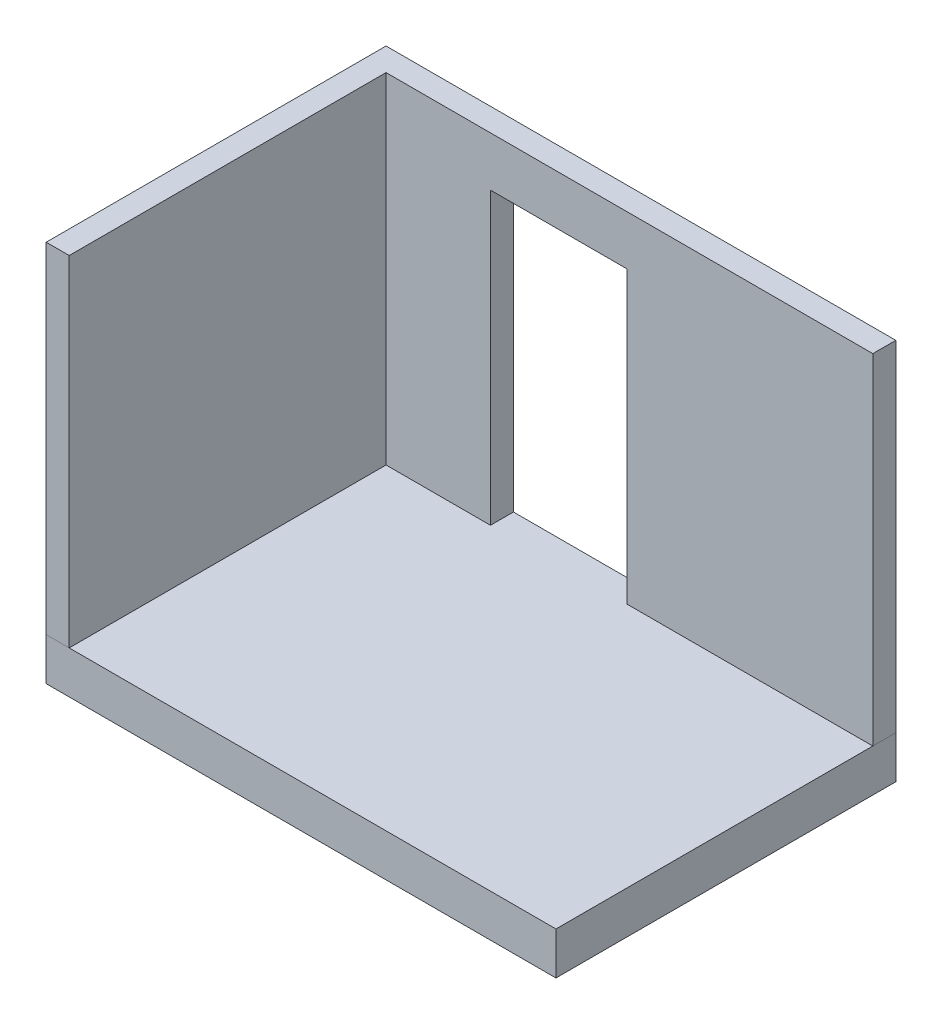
from build123d import *

# Parameters (mm, degrees)
SKETCH1_W           = 3657.6
SKETCH1_H           = 2438.4
FLOOR_2_DEPTH       = 304.8
WALLS_DEPTH         = 2438.4
SKETCH3_W           = 977.9
SKETCH3_H           = 2082.8
ROUGH_OPENING_DEPTH = 2438.4


with BuildPart() as part:
    # Sketch1 → Floor 2 (new body)
    with BuildSketch(Plane(origin=(0, 0, 0), x_dir=(1, 0, 0), z_dir=(0, 1, 0))):
        with Locations((1828.8, -1219.2)):
            Rectangle(SKETCH1_W, SKETCH1_H)
    extrude(amount=-FLOOR_2_DEPTH)


with BuildPart() as body_2:
    # Sketch2 → Walls (new body)
    with BuildSketch(Plane(origin=(0, 0, 0), x_dir=(1, 0, 0), z_dir=(0, 1, 0))):
        Polygon((3657.6, -165.1), (165.1, -165.1), (165.1, -2438.4), (0, -2438.4), (0, 0), (3657.6, 0), align=None)
    extrude(amount=WALLS_DEPTH)

    # Sketch3 → Rough Opening (cut)
    with BuildSketch(Plane(origin=(0, 0, 0), x_dir=(-1, 0, 0), z_dir=(0, 0, -1))):
        with Locations((-1403.35, 1041.4)):
            Rectangle(SKETCH3_W, SKETCH3_H)
    extrude(amount=-ROUGH_OPENING_DEPTH, mode=Mode.SUBTRACT)


solid = Compound([part.part, body_2.part])
